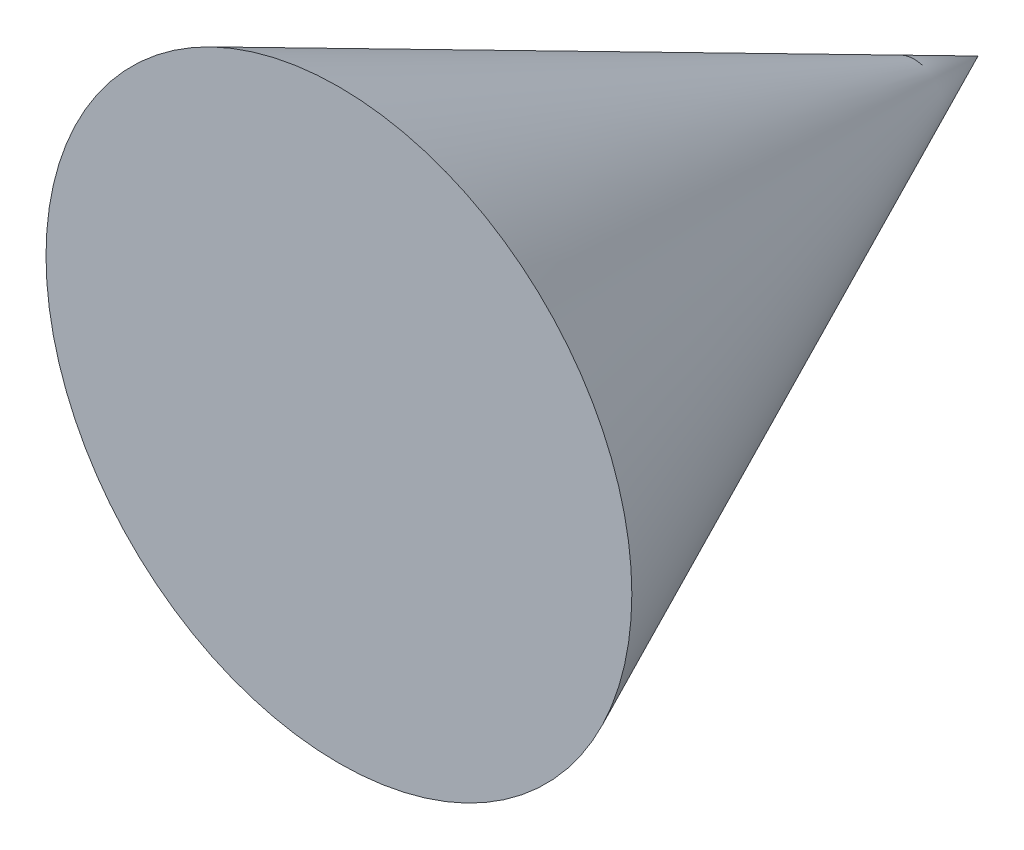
from build123d import *


with BuildPart() as part:
    # Sketch 1 → Revolve 1 (revolve)
    with BuildSketch(Plane(origin=(0, 0, 0), x_dir=(1, 0, 0), z_dir=(0, 1, 0)), mode=Mode.PRIVATE) as revolve_1_sk:
        Polygon((0, 40.343817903), (-25, -14.19974267), (0, -14.19974267), align=None)
    revolve(revolve_1_sk.sketch.rotate(Axis((0, 0, -54.161764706), (0, 0, 1)), 180), axis=Axis((0, 0, -54.161764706), (0, 0, 1)))


solid = part.part
